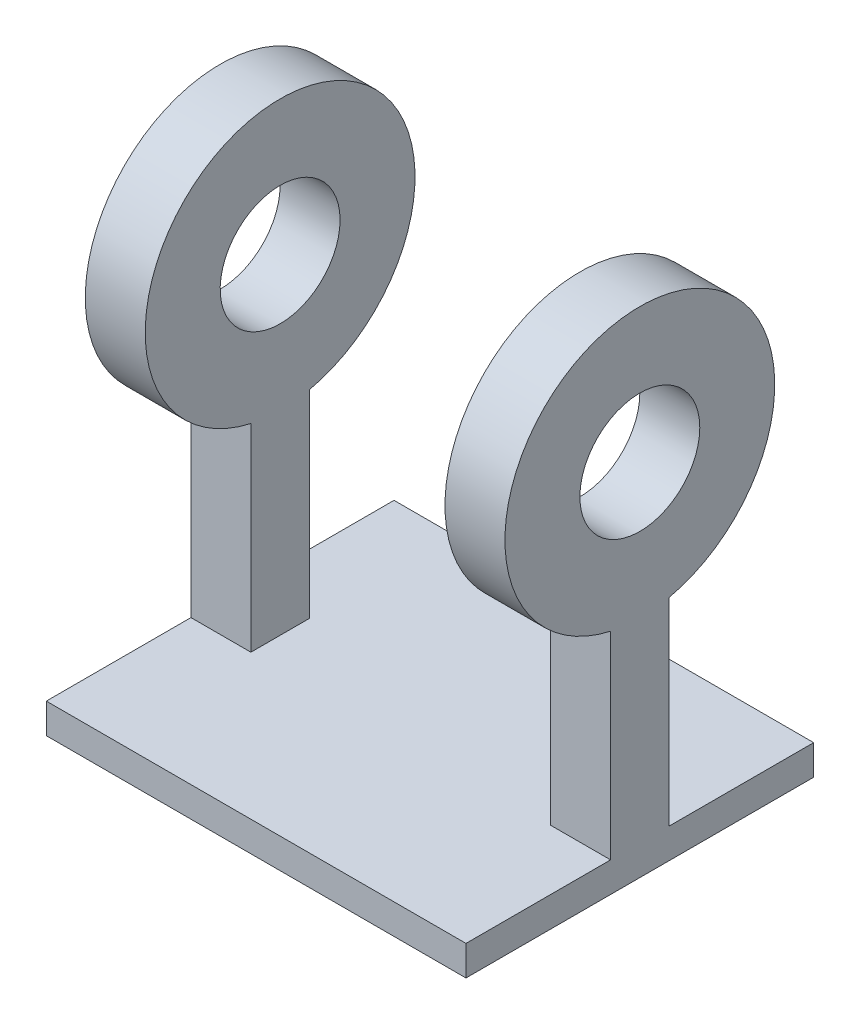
from build123d import *

# Parameters (mm, degrees)
BOSS_EXTRU_1_DEPTH      = 70
ESQUISSE4_R             = 22.5
ESQUISSE4_R_2           = 10
BOSS_EXTRU_2_DEPTH      = 70
ESQUISSE5_W             = 50
ESQUISSE5_H             = 77.5
ENL_V_MAT_EXTRU_3_DEPTH = 43
ESQUISSE8_W             = 50
ESQUISSE8_H             = 43.931053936
ENL_V_MAT_EXTRU_4_DEPTH = 43


with BuildPart() as part:
    # Esquisse3 → Boss.-Extru.1 (new body)
    with BuildSketch(Plane(origin=(0, 0, 0), x_dir=(0, 0, -1), z_dir=(1, 0, 0))):
        Polygon((0, 0), (24.125, 0), (24.125, -5), (-33.875, -5), (-33.875, 0), (-9.75, 0), (-9.75, 33.034473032), (0, 33.034473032), align=None)
    extrude(amount=BOSS_EXTRU_1_DEPTH)

    # Esquisse4 → Boss.-Extru.2 (add)
    with BuildSketch(Plane(origin=(70, 0, 0), x_dir=(0, 0, -1), z_dir=(1, 0, 0))):
        with Locations((-4.875, 55)):
            Circle(ESQUISSE4_R)
        with Locations((-4.875, 55)):
            Circle(ESQUISSE4_R_2, mode=Mode.SUBTRACT)
    extrude(amount=-BOSS_EXTRU_2_DEPTH)

    # Esquisse5 → Enl_v. mat.-Extru.3 (cut)
    with BuildSketch(Plane.XY.offset(9.75)):
        with Locations((35, 38.75)):
            Rectangle(ESQUISSE5_W, ESQUISSE5_H)
    extrude(amount=-ENL_V_MAT_EXTRU_3_DEPTH, mode=Mode.SUBTRACT)

    # Esquisse8 → Enl_v. mat.-Extru.4 (cut)
    with BuildSketch(Plane(origin=(0, 0, 9.75), x_dir=(-1, 0, 0), z_dir=(0, 0, -1))):
        with Locations((-35, 55)):
            Rectangle(ESQUISSE8_W, ESQUISSE8_H)
    extrude(amount=-ENL_V_MAT_EXTRU_4_DEPTH, mode=Mode.SUBTRACT)


solid = part.part
